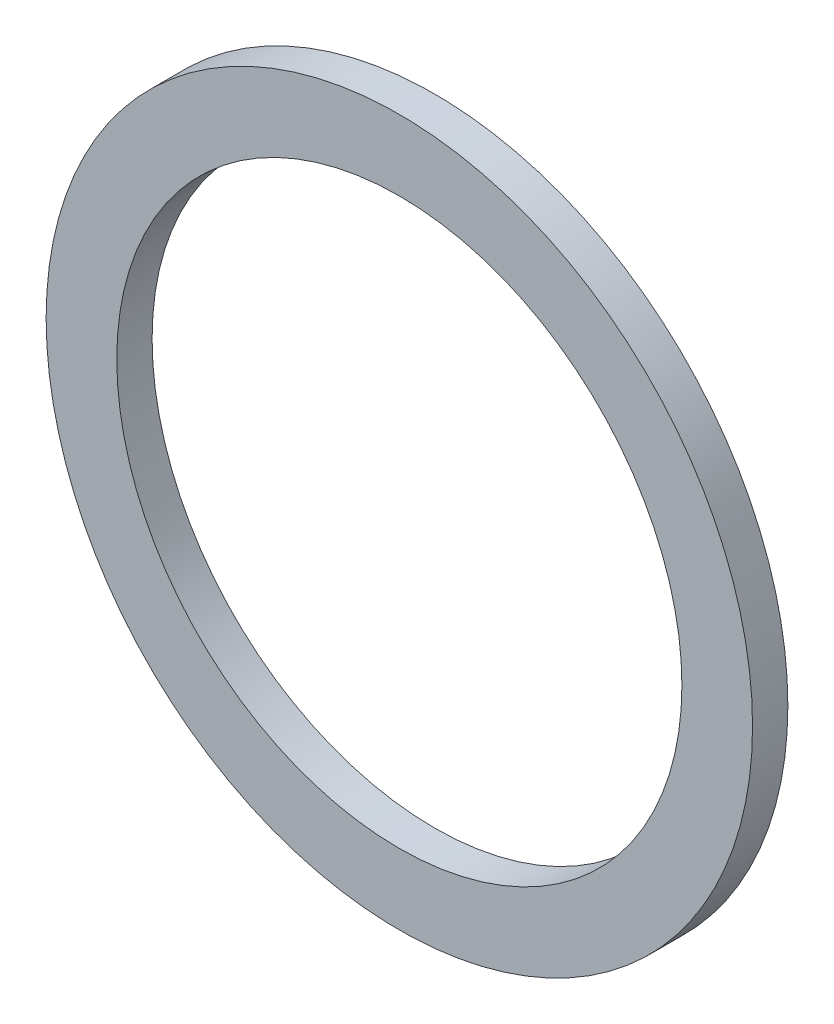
from build123d import *

# Parameters (mm, degrees)
ESQUISSE1_R      = 50
ESQUISSE1_R_2    = 40
EXTRUSION1_DEPTH = 5


with BuildPart() as part:
    # Esquisse1 → Extrusion1 (new body)
    with BuildSketch(Plane.XY):
        Circle(ESQUISSE1_R)
        Circle(ESQUISSE1_R_2, mode=Mode.SUBTRACT)
    extrude(amount=EXTRUSION1_DEPTH)


solid = part.part
